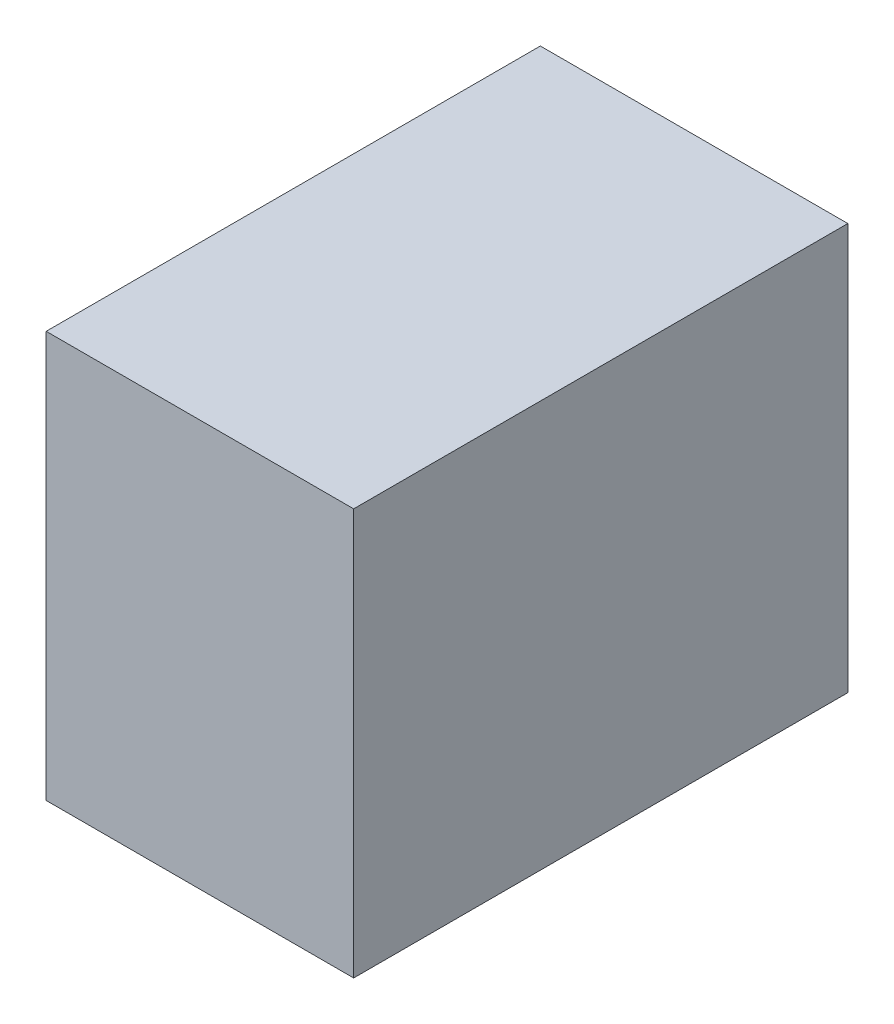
ISO-10303-21;
HEADER;
FILE_DESCRIPTION(('STEP AP214'),'2;1');
FILE_NAME('part.step','',(''),(''),'','','');
FILE_SCHEMA(('AUTOMOTIVE_DESIGN { 1 0 10303 214 1 1 1 1 }'));
ENDSEC;
DATA;
#1=APPLICATION_CONTEXT('core data for automotive mechanical design processes');
#2=APPLICATION_PROTOCOL_DEFINITION('international standard','automotive_design',2000,#1);
#3=PRODUCT_CONTEXT('',#1,'mechanical');
#4=PRODUCT('Part','Part','',(#3));
#5=PRODUCT_RELATED_PRODUCT_CATEGORY('part','',(#4));
#6=PRODUCT_DEFINITION_FORMATION('','',#4);
#7=PRODUCT_DEFINITION_CONTEXT('part definition',#1,'design');
#8=PRODUCT_DEFINITION('design','',#6,#7);
#9=PRODUCT_DEFINITION_SHAPE('','',#8);
#10=(LENGTH_UNIT() NAMED_UNIT(*) SI_UNIT(.MILLI.,.METRE.));
#11=(NAMED_UNIT(*) PLANE_ANGLE_UNIT() SI_UNIT($,.RADIAN.));
#12=(NAMED_UNIT(*) SI_UNIT($,.STERADIAN.) SOLID_ANGLE_UNIT());
#13=UNCERTAINTY_MEASURE_WITH_UNIT(LENGTH_MEASURE(1.E-05),#10,'distance_accuracy_value','');
#14=(GEOMETRIC_REPRESENTATION_CONTEXT(3) GLOBAL_UNCERTAINTY_ASSIGNED_CONTEXT((#13)) GLOBAL_UNIT_ASSIGNED_CONTEXT((#10,
#11,#12)) REPRESENTATION_CONTEXT('',''));
#15=CARTESIAN_POINT('',(0.,0.,0.));
#16=DIRECTION('',(0.,0.,1.));
#17=DIRECTION('',(1.,0.,0.));
#18=AXIS2_PLACEMENT_3D('',#15,#16,#17);
#19=CARTESIAN_POINT('',(2.90000000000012,33.1383297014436,45.));
#20=DIRECTION('',(0.,-1.,0.));
#21=DIRECTION('',(0.,0.,-1.));
#22=AXIS2_PLACEMENT_3D('',#19,#20,#21);
#23=PLANE('',#22);
#24=DIRECTION('',(-1.,0.,0.));
#25=VECTOR('',#24,1.);
#26=CARTESIAN_POINT('',(2.90000000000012,33.1383297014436,0.));
#27=LINE('',#26,#25);
#28=CARTESIAN_POINT('',(30.9000000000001,33.1383297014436,0.));
#29=VERTEX_POINT('',#28);
#30=CARTESIAN_POINT('',(2.90000000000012,33.1383297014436,0.));
#31=VERTEX_POINT('',#30);
#32=EDGE_CURVE('E96',#29,#31,#27,.T.);
#33=ORIENTED_EDGE('',*,*,#32,.T.);
#34=DIRECTION('',(0.,0.,-1.));
#35=VECTOR('',#34,1.);
#36=CARTESIAN_POINT('',(2.90000000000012,33.1383297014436,45.));
#37=LINE('',#36,#35);
#38=CARTESIAN_POINT('',(2.90000000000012,33.1383297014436,45.));
#39=VERTEX_POINT('',#38);
#40=EDGE_CURVE('E11',#39,#31,#37,.T.);
#41=ORIENTED_EDGE('',*,*,#40,.F.);
#42=DIRECTION('',(-1.,0.,0.));
#43=VECTOR('',#42,1.);
#44=CARTESIAN_POINT('',(2.90000000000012,33.1383297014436,45.));
#45=LINE('',#44,#43);
#46=CARTESIAN_POINT('',(30.9000000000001,33.1383297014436,45.));
#47=VERTEX_POINT('',#46);
#48=EDGE_CURVE('E84',#47,#39,#45,.T.);
#49=ORIENTED_EDGE('',*,*,#48,.F.);
#50=DIRECTION('',(0.,0.,-1.));
#51=VECTOR('',#50,1.);
#52=CARTESIAN_POINT('',(30.9000000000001,33.1383297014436,45.));
#53=LINE('',#52,#51);
#54=EDGE_CURVE('E92',#47,#29,#53,.T.);
#55=ORIENTED_EDGE('',*,*,#54,.T.);
#56=EDGE_LOOP('',(#33,#41,#49,#55));
#57=FACE_BOUND('',#56,.T.);
#58=ADVANCED_FACE('F33',(#57),#23,.F.);
#59=CARTESIAN_POINT('',(2.90000000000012,33.1383297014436,45.));
#60=DIRECTION('',(1.,0.,0.));
#61=DIRECTION('',(0.,0.,-1.));
#62=AXIS2_PLACEMENT_3D('',#59,#60,#61);
#63=PLANE('',#62);
#64=DIRECTION('',(0.,-1.,0.));
#65=VECTOR('',#64,1.);
#66=CARTESIAN_POINT('',(2.90000000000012,33.1383297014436,0.));
#67=LINE('',#66,#65);
#68=CARTESIAN_POINT('',(2.90000000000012,-3.86167029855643,0.));
#69=VERTEX_POINT('',#68);
#70=EDGE_CURVE('E88',#31,#69,#67,.T.);
#71=ORIENTED_EDGE('',*,*,#70,.T.);
#72=DIRECTION('',(0.,0.,-1.));
#73=VECTOR('',#72,1.);
#74=CARTESIAN_POINT('',(2.90000000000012,-3.86167029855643,45.));
#75=LINE('',#74,#73);
#76=CARTESIAN_POINT('',(2.90000000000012,-3.86167029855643,45.));
#77=VERTEX_POINT('',#76);
#78=EDGE_CURVE('E41',#77,#69,#75,.T.);
#79=ORIENTED_EDGE('',*,*,#78,.F.);
#80=DIRECTION('',(0.,-1.,0.));
#81=VECTOR('',#80,1.);
#82=CARTESIAN_POINT('',(2.90000000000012,33.1383297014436,45.));
#83=LINE('',#82,#81);
#84=EDGE_CURVE('E79',#39,#77,#83,.T.);
#85=ORIENTED_EDGE('',*,*,#84,.F.);
#86=ORIENTED_EDGE('',*,*,#40,.T.);
#87=EDGE_LOOP('',(#71,#79,#85,#86));
#88=FACE_BOUND('',#87,.T.);
#89=ADVANCED_FACE('F87',(#88),#63,.F.);
#90=CARTESIAN_POINT('',(2.90000000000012,-3.86167029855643,45.));
#91=DIRECTION('',(0.,1.,0.));
#92=DIRECTION('',(0.,0.,1.));
#93=AXIS2_PLACEMENT_3D('',#90,#91,#92);
#94=PLANE('',#93);
#95=DIRECTION('',(1.,0.,0.));
#96=VECTOR('',#95,1.);
#97=CARTESIAN_POINT('',(2.90000000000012,-3.86167029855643,0.));
#98=LINE('',#97,#96);
#99=CARTESIAN_POINT('',(30.9000000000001,-3.86167029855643,0.));
#100=VERTEX_POINT('',#99);
#101=EDGE_CURVE('E66',#69,#100,#98,.T.);
#102=ORIENTED_EDGE('',*,*,#101,.T.);
#103=DIRECTION('',(0.,0.,-1.));
#104=VECTOR('',#103,1.);
#105=CARTESIAN_POINT('',(30.9000000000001,-3.86167029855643,45.));
#106=LINE('',#105,#104);
#107=CARTESIAN_POINT('',(30.9000000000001,-3.86167029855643,45.));
#108=VERTEX_POINT('',#107);
#109=EDGE_CURVE('E89',#108,#100,#106,.T.);
#110=ORIENTED_EDGE('',*,*,#109,.F.);
#111=DIRECTION('',(1.,0.,0.));
#112=VECTOR('',#111,1.);
#113=CARTESIAN_POINT('',(2.90000000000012,-3.86167029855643,45.));
#114=LINE('',#113,#112);
#115=EDGE_CURVE('E82',#77,#108,#114,.T.);
#116=ORIENTED_EDGE('',*,*,#115,.F.);
#117=ORIENTED_EDGE('',*,*,#78,.T.);
#118=EDGE_LOOP('',(#102,#110,#116,#117));
#119=FACE_BOUND('',#118,.T.);
#120=ADVANCED_FACE('F90',(#119),#94,.F.);
#121=CARTESIAN_POINT('',(30.9000000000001,-3.86167029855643,45.));
#122=DIRECTION('',(-1.,0.,0.));
#123=DIRECTION('',(0.,0.,1.));
#124=AXIS2_PLACEMENT_3D('',#121,#122,#123);
#125=PLANE('',#124);
#126=DIRECTION('',(0.,1.,0.));
#127=VECTOR('',#126,1.);
#128=CARTESIAN_POINT('',(30.9000000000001,-3.86167029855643,0.));
#129=LINE('',#128,#127);
#130=EDGE_CURVE('E72',#100,#29,#129,.T.);
#131=ORIENTED_EDGE('',*,*,#130,.T.);
#132=ORIENTED_EDGE('',*,*,#54,.F.);
#133=DIRECTION('',(0.,1.,0.));
#134=VECTOR('',#133,1.);
#135=CARTESIAN_POINT('',(30.9000000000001,-3.86167029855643,45.));
#136=LINE('',#135,#134);
#137=EDGE_CURVE('E49',#108,#47,#136,.T.);
#138=ORIENTED_EDGE('',*,*,#137,.F.);
#139=ORIENTED_EDGE('',*,*,#109,.T.);
#140=EDGE_LOOP('',(#131,#132,#138,#139));
#141=FACE_BOUND('',#140,.T.);
#142=ADVANCED_FACE('F103',(#141),#125,.F.);
#143=CARTESIAN_POINT('',(0.,0.,45.));
#144=DIRECTION('',(0.,0.,1.));
#145=DIRECTION('',(1.,0.,0.));
#146=AXIS2_PLACEMENT_3D('',#143,#144,#145);
#147=PLANE('',#146);
#148=ORIENTED_EDGE('',*,*,#48,.T.);
#149=ORIENTED_EDGE('',*,*,#84,.T.);
#150=ORIENTED_EDGE('',*,*,#115,.T.);
#151=ORIENTED_EDGE('',*,*,#137,.T.);
#152=EDGE_LOOP('',(#148,#149,#150,#151));
#153=FACE_BOUND('',#152,.T.);
#154=ADVANCED_FACE('F80',(#153),#147,.T.);
#155=CARTESIAN_POINT('',(0.,0.,0.));
#156=DIRECTION('',(0.,0.,1.));
#157=DIRECTION('',(1.,0.,0.));
#158=AXIS2_PLACEMENT_3D('',#155,#156,#157);
#159=PLANE('',#158);
#160=ORIENTED_EDGE('',*,*,#32,.F.);
#161=ORIENTED_EDGE('',*,*,#130,.F.);
#162=ORIENTED_EDGE('',*,*,#101,.F.);
#163=ORIENTED_EDGE('',*,*,#70,.F.);
#164=EDGE_LOOP('',(#160,#161,#162,#163));
#165=FACE_BOUND('',#164,.T.);
#166=ADVANCED_FACE('F106',(#165),#159,.F.);
#167=CLOSED_SHELL('',(#58,#89,#120,#142,#154,#166));
#168=MANIFOLD_SOLID_BREP('B2',#167);
#169=ADVANCED_BREP_SHAPE_REPRESENTATION('',(#18,#168),#14);
#170=SHAPE_DEFINITION_REPRESENTATION(#9,#169);
ENDSEC;
END-ISO-10303-21;
